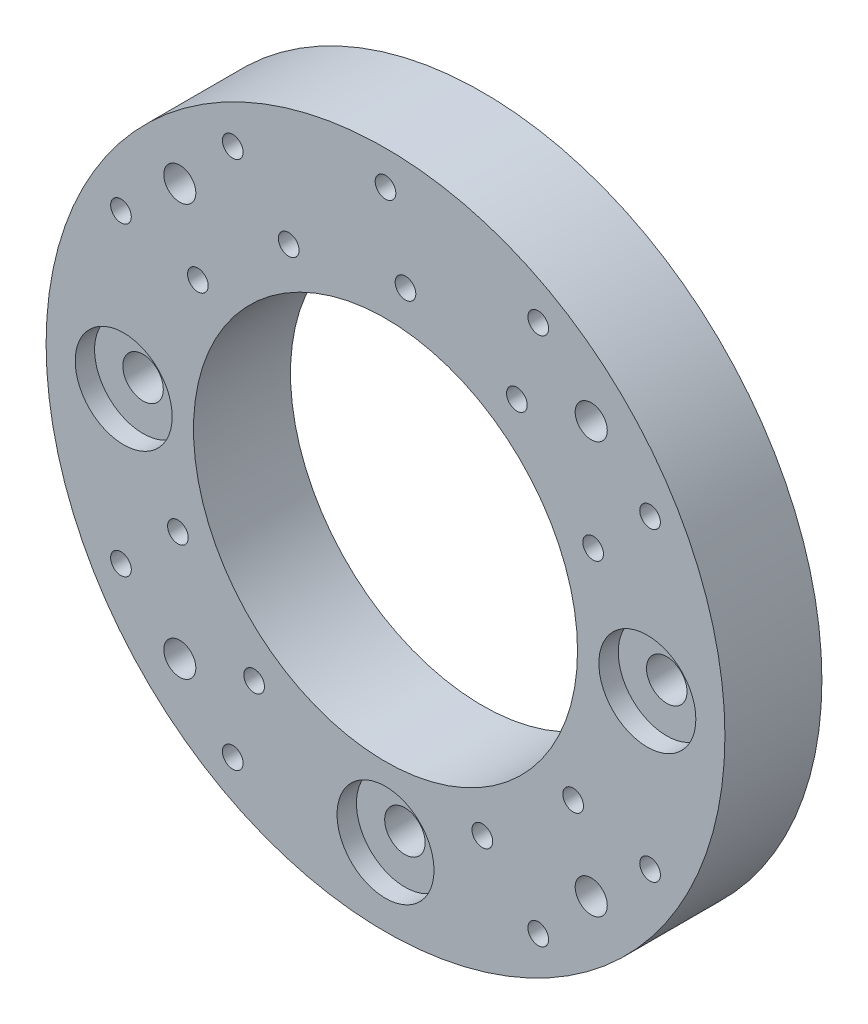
from build123d import *

# Parameters (mm, degrees)
SKETCH1_R                     = 44.45
SKETCH1_R_2                   = 25.146
BOSS_EXTRUDE1_DEPTH           = 12.7
CSK_FOR_M5_SFHCS1_D           = 5.3
CSK_FOR_M5_SFHCS1_CSINK_D     = 11.2
CSK_FOR_M5_SFHCS1_CSINK_ANGLE = 90
SKETCH6_R                     = 6.35
CUT_EXTRUDE1_DEPTH            = 2.54
M5_TAPPED_HOLE1_D             = 4.2
M5_TAPPED_HOLE1_DEPTH         = 9.525
M5_TAPPED_HOLE1_TIP           = 1.2618073
F_6_32_TAPPED_HOLE2_D         = 2.7051


with BuildPart() as part:
    # Sketch1 → Boss-Extrude1 (new body)
    with BuildSketch(Plane.XY):
        Circle(SKETCH1_R)
        Circle(SKETCH1_R_2, mode=Mode.SUBTRACT)
    extrude(amount=BOSS_EXTRUDE1_DEPTH)

    # CSK for M5 SFHCS1 (through all)
    with Locations(Plane(origin=(0, 0, 0), x_dir=(-1, 0, 0), z_dir=(0, 0, -1))):
        with Locations((-34.29, 0), (0, -34.29), (34.29, 0)):
            CounterSinkHole(CSK_FOR_M5_SFHCS1_D / 2, CSK_FOR_M5_SFHCS1_CSINK_D / 2, counter_sink_angle=CSK_FOR_M5_SFHCS1_CSINK_ANGLE)

    # Sketch6 → Cut-Extrude1 (cut)
    with BuildSketch(Plane.XY.offset(12.7)):
        with Locations((-34.29, 0)):
            Circle(SKETCH6_R)
        with Locations((34.29, 0)):
            Circle(SKETCH6_R)
        with Locations((0, -34.29)):
            Circle(SKETCH6_R)
    extrude(amount=-CUT_EXTRUDE1_DEPTH, mode=Mode.SUBTRACT)

    # M5 Tapped Hole1
    with Locations(Plane.XY.offset(12.7)):
        with Locations((-26.940768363, 26.940768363), (26.940768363, 26.940768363), (26.940768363, -26.940768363), (-26.940768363, -26.940768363)):
            Hole(M5_TAPPED_HOLE1_D / 2, depth=M5_TAPPED_HOLE1_DEPTH)
            with Locations((0, 0, -(M5_TAPPED_HOLE1_DEPTH + M5_TAPPED_HOLE1_TIP / 2))):  # 118° drill point
                Cone(0, M5_TAPPED_HOLE1_D / 2, M5_TAPPED_HOLE1_TIP, mode=Mode.SUBTRACT)

    # 6-32 Tapped Hole2 (through all)
    with Locations(Plane(origin=(0, 0, 0), x_dir=(-1, 0, 0), z_dir=(0, 0, -1))):
        with Locations((-17.205801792, 24.572431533), (-20.0025, 34.645346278), (0, 40.005), (-2.614445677, 29.883250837), (20.0025, 34.645346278), (12.677449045, 27.186877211), (24.572431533, 17.205801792), (34.645346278, 20.0025), (27.186877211, -12.677449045), (34.645346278, -20.0025), (20.0025, -34.645346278), (17.205801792, -24.572431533), (-12.677449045, -27.186877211), (-20.0025, -34.645346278), (-24.572431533, -17.205801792), (-34.645346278, -20.0025), (-27.186877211, 12.677449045), (-34.645346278, 20.0025)):
            Hole(F_6_32_TAPPED_HOLE2_D / 2)


solid = part.part
